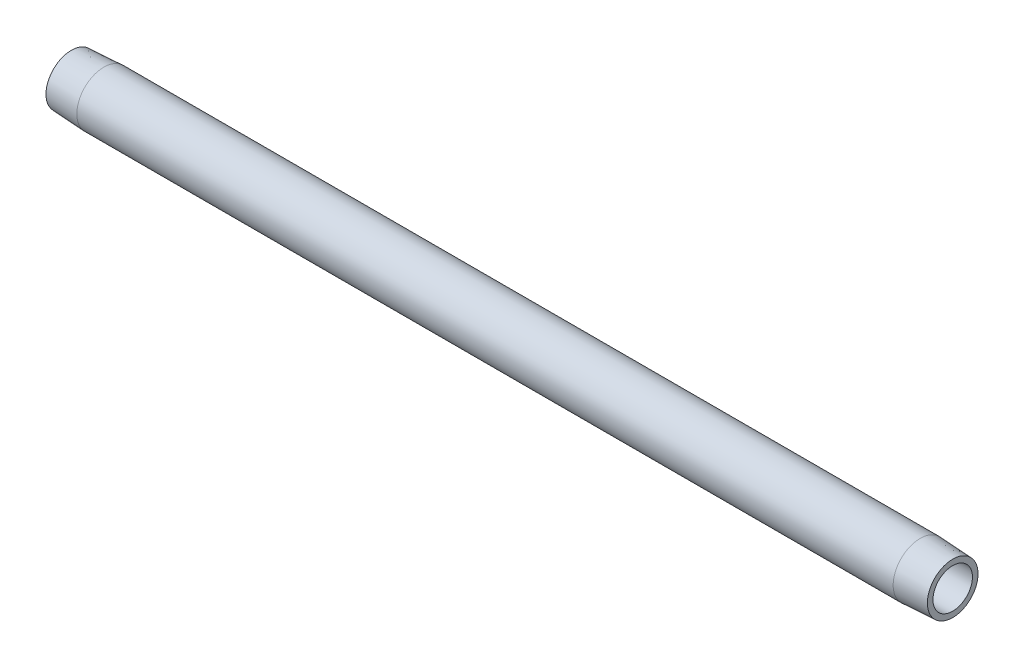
ISO-10303-21;
HEADER;
FILE_DESCRIPTION(('STEP AP214'),'2;1');
FILE_NAME('part.step','',(''),(''),'','','');
FILE_SCHEMA(('AUTOMOTIVE_DESIGN { 1 0 10303 214 1 1 1 1 }'));
ENDSEC;
DATA;
#1=APPLICATION_CONTEXT('core data for automotive mechanical design processes');
#2=APPLICATION_PROTOCOL_DEFINITION('international standard','automotive_design',2000,#1);
#3=PRODUCT_CONTEXT('',#1,'mechanical');
#4=PRODUCT('Part','Part','',(#3));
#5=PRODUCT_RELATED_PRODUCT_CATEGORY('part','',(#4));
#6=PRODUCT_DEFINITION_FORMATION('','',#4);
#7=PRODUCT_DEFINITION_CONTEXT('part definition',#1,'design');
#8=PRODUCT_DEFINITION('design','',#6,#7);
#9=PRODUCT_DEFINITION_SHAPE('','',#8);
#10=(LENGTH_UNIT() NAMED_UNIT(*) SI_UNIT(.MILLI.,.METRE.));
#11=(NAMED_UNIT(*) PLANE_ANGLE_UNIT() SI_UNIT($,.RADIAN.));
#12=(NAMED_UNIT(*) SI_UNIT($,.STERADIAN.) SOLID_ANGLE_UNIT());
#13=UNCERTAINTY_MEASURE_WITH_UNIT(LENGTH_MEASURE(1.E-05),#10,'distance_accuracy_value','');
#14=(GEOMETRIC_REPRESENTATION_CONTEXT(3) GLOBAL_UNCERTAINTY_ASSIGNED_CONTEXT((#13)) GLOBAL_UNIT_ASSIGNED_CONTEXT((#10,
#11,#12)) REPRESENTATION_CONTEXT('',''));
#15=CARTESIAN_POINT('',(0.,0.,0.));
#16=DIRECTION('',(0.,0.,1.));
#17=DIRECTION('',(1.,0.,0.));
#18=AXIS2_PLACEMENT_3D('',#15,#16,#17);
#19=CARTESIAN_POINT('',(279.4,6.26110000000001,0.));
#20=DIRECTION('',(-1.,0.,0.));
#21=DIRECTION('',(0.,0.,1.));
#22=AXIS2_PLACEMENT_3D('',#19,#20,#21);
#23=PLANE('',#22);
#24=CARTESIAN_POINT('',(279.4,0.,0.));
#25=DIRECTION('',(-1.,0.,0.));
#26=DIRECTION('',(0.,0.,1.));
#27=AXIS2_PLACEMENT_3D('',#24,#25,#26);
#28=CIRCLE('',#27,8.03205001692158);
#29=CARTESIAN_POINT('',(279.4,0.,8.03205001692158));
#30=VERTEX_POINT('',#29);
#31=EDGE_CURVE('E10',#30,#30,#28,.T.);
#32=ORIENTED_EDGE('',*,*,#31,.F.);
#33=EDGE_LOOP('',(#32));
#34=FACE_BOUND('',#33,.T.);
#35=CARTESIAN_POINT('',(279.4,0.,0.));
#36=DIRECTION('',(-1.,0.,0.));
#37=DIRECTION('',(0.,0.,1.));
#38=AXIS2_PLACEMENT_3D('',#35,#36,#37);
#39=CIRCLE('',#38,6.26110000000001);
#40=CARTESIAN_POINT('',(279.4,0.,6.26110000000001));
#41=VERTEX_POINT('',#40);
#42=EDGE_CURVE('E52',#41,#41,#39,.T.);
#43=ORIENTED_EDGE('',*,*,#42,.T.);
#44=EDGE_LOOP('',(#43));
#45=FACE_BOUND('',#44,.T.);
#46=ADVANCED_FACE('F30',(#34,#45),#23,.F.);
#47=CARTESIAN_POINT('',(279.4,0.,0.));
#48=DIRECTION('',(-1.,0.,0.));
#49=DIRECTION('',(0.,0.,1.));
#50=AXIS2_PLACEMENT_3D('',#47,#48,#49);
#51=CONICAL_SURFACE('',#50,8.03205001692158,0.0523598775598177);
#52=CARTESIAN_POINT('',(269.0876,0.,0.));
#53=DIRECTION('',(-1.,0.,0.));
#54=DIRECTION('',(0.,0.,1.));
#55=AXIS2_PLACEMENT_3D('',#52,#53,#54);
#56=CIRCLE('',#55,8.57249999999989);
#57=CARTESIAN_POINT('',(269.0876,0.,8.57249999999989));
#58=VERTEX_POINT('',#57);
#59=EDGE_CURVE('E36',#58,#58,#56,.T.);
#60=ORIENTED_EDGE('',*,*,#59,.F.);
#61=EDGE_LOOP('',(#60));
#62=FACE_BOUND('',#61,.T.);
#63=ORIENTED_EDGE('',*,*,#31,.T.);
#64=EDGE_LOOP('',(#63));
#65=FACE_BOUND('',#64,.T.);
#66=ADVANCED_FACE('F77',(#62,#65),#51,.T.);
#67=CARTESIAN_POINT('',(0.,0.,0.));
#68=DIRECTION('',(-1.,0.,0.));
#69=DIRECTION('',(0.,0.,1.));
#70=AXIS2_PLACEMENT_3D('',#67,#68,#69);
#71=CYLINDRICAL_SURFACE('',#70,8.57249999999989);
#72=CARTESIAN_POINT('',(10.3124,0.,0.));
#73=DIRECTION('',(-1.,0.,0.));
#74=DIRECTION('',(0.,0.,1.));
#75=AXIS2_PLACEMENT_3D('',#72,#73,#74);
#76=CIRCLE('',#75,8.57249999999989);
#77=CARTESIAN_POINT('',(10.3124,0.,8.57249999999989));
#78=VERTEX_POINT('',#77);
#79=EDGE_CURVE('E40',#78,#78,#76,.T.);
#80=ORIENTED_EDGE('',*,*,#79,.F.);
#81=EDGE_LOOP('',(#80));
#82=FACE_BOUND('',#81,.T.);
#83=ORIENTED_EDGE('',*,*,#59,.T.);
#84=EDGE_LOOP('',(#83));
#85=FACE_BOUND('',#84,.T.);
#86=ADVANCED_FACE('F72',(#82,#85),#71,.T.);
#87=CARTESIAN_POINT('',(10.3124,0.,0.));
#88=DIRECTION('',(1.,0.,0.));
#89=DIRECTION('',(0.,0.,-1.));
#90=AXIS2_PLACEMENT_3D('',#87,#88,#89);
#91=CONICAL_SURFACE('',#90,8.57249999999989,0.0523598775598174);
#92=CARTESIAN_POINT('',(0.,0.,0.));
#93=DIRECTION('',(-1.,0.,0.));
#94=DIRECTION('',(0.,0.,1.));
#95=AXIS2_PLACEMENT_3D('',#92,#93,#94);
#96=CIRCLE('',#95,8.03205001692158);
#97=CARTESIAN_POINT('',(0.,0.,8.03205001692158));
#98=VERTEX_POINT('',#97);
#99=EDGE_CURVE('E44',#98,#98,#96,.T.);
#100=ORIENTED_EDGE('',*,*,#99,.F.);
#101=EDGE_LOOP('',(#100));
#102=FACE_BOUND('',#101,.T.);
#103=ORIENTED_EDGE('',*,*,#79,.T.);
#104=EDGE_LOOP('',(#103));
#105=FACE_BOUND('',#104,.T.);
#106=ADVANCED_FACE('F66',(#102,#105),#91,.T.);
#107=CARTESIAN_POINT('',(0.,6.26110000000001,0.));
#108=DIRECTION('',(1.,0.,0.));
#109=DIRECTION('',(0.,0.,-1.));
#110=AXIS2_PLACEMENT_3D('',#107,#108,#109);
#111=PLANE('',#110);
#112=CARTESIAN_POINT('',(0.,0.,0.));
#113=DIRECTION('',(-1.,0.,0.));
#114=DIRECTION('',(0.,0.,1.));
#115=AXIS2_PLACEMENT_3D('',#112,#113,#114);
#116=CIRCLE('',#115,6.26110000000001);
#117=CARTESIAN_POINT('',(0.,0.,6.26110000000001));
#118=VERTEX_POINT('',#117);
#119=EDGE_CURVE('E49',#118,#118,#116,.T.);
#120=ORIENTED_EDGE('',*,*,#119,.F.);
#121=EDGE_LOOP('',(#120));
#122=FACE_BOUND('',#121,.T.);
#123=ORIENTED_EDGE('',*,*,#99,.T.);
#124=EDGE_LOOP('',(#123));
#125=FACE_BOUND('',#124,.T.);
#126=ADVANCED_FACE('F60',(#122,#125),#111,.F.);
#127=CARTESIAN_POINT('',(0.,0.,0.));
#128=DIRECTION('',(-1.,0.,0.));
#129=DIRECTION('',(0.,0.,1.));
#130=AXIS2_PLACEMENT_3D('',#127,#128,#129);
#131=CYLINDRICAL_SURFACE('',#130,6.26110000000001);
#132=ORIENTED_EDGE('',*,*,#42,.F.);
#133=EDGE_LOOP('',(#132));
#134=FACE_BOUND('',#133,.T.);
#135=ORIENTED_EDGE('',*,*,#119,.T.);
#136=EDGE_LOOP('',(#135));
#137=FACE_BOUND('',#136,.T.);
#138=ADVANCED_FACE('F57',(#134,#137),#131,.F.);
#139=CLOSED_SHELL('',(#46,#66,#86,#106,#126,#138));
#140=MANIFOLD_SOLID_BREP('B2',#139);
#141=ADVANCED_BREP_SHAPE_REPRESENTATION('',(#18,#140),#14);
#142=SHAPE_DEFINITION_REPRESENTATION(#9,#141);
ENDSEC;
END-ISO-10303-21;
